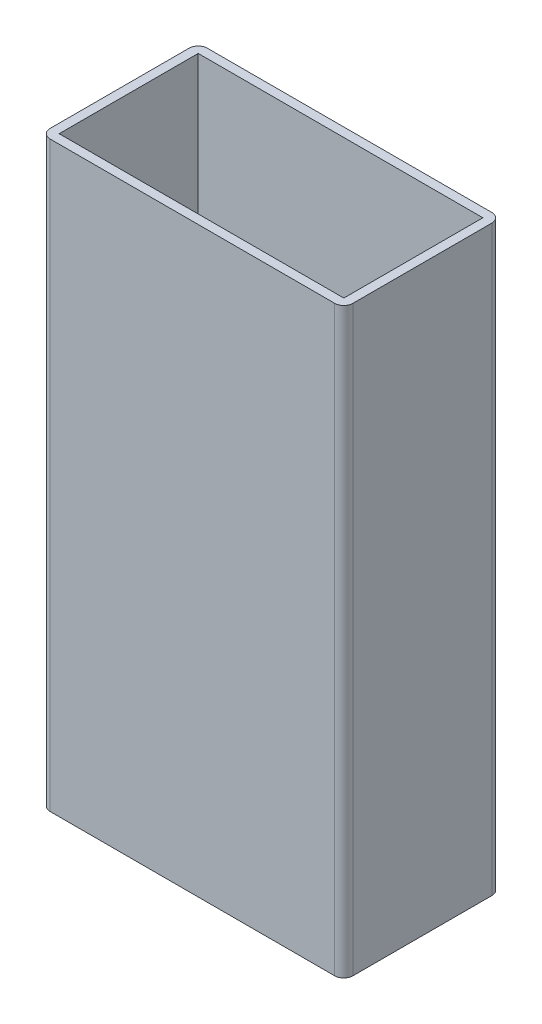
ISO-10303-21;
HEADER;
FILE_DESCRIPTION(('STEP AP214'),'2;1');
FILE_NAME('part.step','',(''),(''),'','','');
FILE_SCHEMA(('AUTOMOTIVE_DESIGN { 1 0 10303 214 1 1 1 1 }'));
ENDSEC;
DATA;
#1=APPLICATION_CONTEXT('core data for automotive mechanical design processes');
#2=APPLICATION_PROTOCOL_DEFINITION('international standard','automotive_design',2000,#1);
#3=PRODUCT_CONTEXT('',#1,'mechanical');
#4=PRODUCT('Part','Part','',(#3));
#5=PRODUCT_RELATED_PRODUCT_CATEGORY('part','',(#4));
#6=PRODUCT_DEFINITION_FORMATION('','',#4);
#7=PRODUCT_DEFINITION_CONTEXT('part definition',#1,'design');
#8=PRODUCT_DEFINITION('design','',#6,#7);
#9=PRODUCT_DEFINITION_SHAPE('','',#8);
#10=(LENGTH_UNIT() NAMED_UNIT(*) SI_UNIT(.MILLI.,.METRE.));
#11=(NAMED_UNIT(*) PLANE_ANGLE_UNIT() SI_UNIT($,.RADIAN.));
#12=(NAMED_UNIT(*) SI_UNIT($,.STERADIAN.) SOLID_ANGLE_UNIT());
#13=UNCERTAINTY_MEASURE_WITH_UNIT(LENGTH_MEASURE(1.E-05),#10,'distance_accuracy_value','');
#14=(GEOMETRIC_REPRESENTATION_CONTEXT(3) GLOBAL_UNCERTAINTY_ASSIGNED_CONTEXT((#13)) GLOBAL_UNIT_ASSIGNED_CONTEXT((#10,
#11,#12)) REPRESENTATION_CONTEXT('',''));
#15=CARTESIAN_POINT('',(0.,0.,0.));
#16=DIRECTION('',(0.,0.,1.));
#17=DIRECTION('',(1.,0.,0.));
#18=AXIS2_PLACEMENT_3D('',#15,#16,#17);
#19=CARTESIAN_POINT('',(-24.8285,101.6,12.1285));
#20=DIRECTION('',(0.,1.,0.));
#21=DIRECTION('',(0.,0.,1.));
#22=AXIS2_PLACEMENT_3D('',#19,#20,#21);
#23=PLANE('',#22);
#24=CARTESIAN_POINT('',(-24.8285,101.6,12.1285));
#25=DIRECTION('',(0.,1.,0.));
#26=DIRECTION('',(0.,0.,-1.));
#27=AXIS2_PLACEMENT_3D('',#24,#25,#26);
#28=CIRCLE('',#27,1.5875);
#29=CARTESIAN_POINT('',(-26.416,101.6,12.1285));
#30=VERTEX_POINT('',#29);
#31=CARTESIAN_POINT('',(-24.8285,101.6,13.716));
#32=VERTEX_POINT('',#31);
#33=EDGE_CURVE('E219',#30,#32,#28,.T.);
#34=ORIENTED_EDGE('',*,*,#33,.T.);
#35=DIRECTION('',(1.,0.,0.));
#36=VECTOR('',#35,1.);
#37=CARTESIAN_POINT('',(-24.8285,101.6,13.716));
#38=LINE('',#37,#36);
#39=CARTESIAN_POINT('',(24.8285,101.6,13.716));
#40=VERTEX_POINT('',#39);
#41=EDGE_CURVE('E223',#32,#40,#38,.T.);
#42=ORIENTED_EDGE('',*,*,#41,.T.);
#43=CARTESIAN_POINT('',(24.8285,101.6,12.1285));
#44=DIRECTION('',(0.,1.,0.));
#45=DIRECTION('',(0.,0.,1.));
#46=AXIS2_PLACEMENT_3D('',#43,#44,#45);
#47=CIRCLE('',#46,1.5875);
#48=CARTESIAN_POINT('',(26.416,101.6,12.1285));
#49=VERTEX_POINT('',#48);
#50=EDGE_CURVE('E227',#40,#49,#47,.T.);
#51=ORIENTED_EDGE('',*,*,#50,.T.);
#52=DIRECTION('',(0.,0.,-1.));
#53=VECTOR('',#52,1.);
#54=CARTESIAN_POINT('',(26.416,101.6,12.1285));
#55=LINE('',#54,#53);
#56=CARTESIAN_POINT('',(26.416,101.6,-12.1285));
#57=VERTEX_POINT('',#56);
#58=EDGE_CURVE('E230',#49,#57,#55,.T.);
#59=ORIENTED_EDGE('',*,*,#58,.T.);
#60=CARTESIAN_POINT('',(24.8285,101.6,-12.1285));
#61=DIRECTION('',(0.,1.,0.));
#62=DIRECTION('',(0.,0.,-1.));
#63=AXIS2_PLACEMENT_3D('',#60,#61,#62);
#64=CIRCLE('',#63,1.5875);
#65=CARTESIAN_POINT('',(24.8285,101.6,-13.716));
#66=VERTEX_POINT('',#65);
#67=EDGE_CURVE('E233',#57,#66,#64,.T.);
#68=ORIENTED_EDGE('',*,*,#67,.T.);
#69=DIRECTION('',(-1.,0.,0.));
#70=VECTOR('',#69,1.);
#71=CARTESIAN_POINT('',(-24.8285,101.6,-13.716));
#72=LINE('',#71,#70);
#73=CARTESIAN_POINT('',(-24.8285,101.6,-13.716));
#74=VERTEX_POINT('',#73);
#75=EDGE_CURVE('E236',#66,#74,#72,.T.);
#76=ORIENTED_EDGE('',*,*,#75,.T.);
#77=CARTESIAN_POINT('',(-24.8285,101.6,-12.1285));
#78=DIRECTION('',(0.,1.,0.));
#79=DIRECTION('',(0.,0.,-1.));
#80=AXIS2_PLACEMENT_3D('',#77,#78,#79);
#81=CIRCLE('',#80,1.5875);
#82=CARTESIAN_POINT('',(-26.416,101.6,-12.1285));
#83=VERTEX_POINT('',#82);
#84=EDGE_CURVE('E239',#74,#83,#81,.T.);
#85=ORIENTED_EDGE('',*,*,#84,.T.);
#86=DIRECTION('',(0.,0.,1.));
#87=VECTOR('',#86,1.);
#88=CARTESIAN_POINT('',(-26.416,101.6,12.1285));
#89=LINE('',#88,#87);
#90=EDGE_CURVE('E242',#83,#30,#89,.T.);
#91=ORIENTED_EDGE('',*,*,#90,.T.);
#92=EDGE_LOOP('',(#34,#42,#51,#59,#68,#76,#85,#91));
#93=FACE_BOUND('',#92,.T.);
#94=DIRECTION('',(1.,0.,0.));
#95=VECTOR('',#94,1.);
#96=CARTESIAN_POINT('',(-24.8285,101.6,12.1285));
#97=LINE('',#96,#95);
#98=CARTESIAN_POINT('',(-24.8285,101.6,12.1285));
#99=VERTEX_POINT('',#98);
#100=CARTESIAN_POINT('',(24.8285,101.6,12.1285));
#101=VERTEX_POINT('',#100);
#102=EDGE_CURVE('E180',#99,#101,#97,.T.);
#103=ORIENTED_EDGE('',*,*,#102,.F.);
#104=DIRECTION('',(0.,0.,1.));
#105=VECTOR('',#104,1.);
#106=CARTESIAN_POINT('',(-24.8285,101.6,12.1285));
#107=LINE('',#106,#105);
#108=CARTESIAN_POINT('',(-24.8285,101.6,-12.1285));
#109=VERTEX_POINT('',#108);
#110=EDGE_CURVE('E171',#109,#99,#107,.T.);
#111=ORIENTED_EDGE('',*,*,#110,.F.);
#112=DIRECTION('',(-1.,0.,0.));
#113=VECTOR('',#112,1.);
#114=CARTESIAN_POINT('',(-24.8285,101.6,-12.1285));
#115=LINE('',#114,#113);
#116=CARTESIAN_POINT('',(24.8285,101.6,-12.1285));
#117=VERTEX_POINT('',#116);
#118=EDGE_CURVE('E197',#117,#109,#115,.T.);
#119=ORIENTED_EDGE('',*,*,#118,.F.);
#120=DIRECTION('',(0.,0.,-1.));
#121=VECTOR('',#120,1.);
#122=CARTESIAN_POINT('',(24.8285,101.6,12.1285));
#123=LINE('',#122,#121);
#124=EDGE_CURVE('E193',#101,#117,#123,.T.);
#125=ORIENTED_EDGE('',*,*,#124,.F.);
#126=EDGE_LOOP('',(#103,#111,#119,#125));
#127=FACE_BOUND('',#126,.T.);
#128=ADVANCED_FACE('F81',(#93,#127),#23,.T.);
#129=CARTESIAN_POINT('',(-24.8285,0.,12.1285));
#130=DIRECTION('',(0.,1.,0.));
#131=DIRECTION('',(0.,0.,1.));
#132=AXIS2_PLACEMENT_3D('',#129,#130,#131);
#133=PLANE('',#132);
#134=CARTESIAN_POINT('',(-24.8285,0.,12.1285));
#135=DIRECTION('',(0.,1.,0.));
#136=DIRECTION('',(0.,0.,-1.));
#137=AXIS2_PLACEMENT_3D('',#134,#135,#136);
#138=CIRCLE('',#137,1.5875);
#139=CARTESIAN_POINT('',(-26.416,0.,12.1285));
#140=VERTEX_POINT('',#139);
#141=CARTESIAN_POINT('',(-24.8285,0.,13.716));
#142=VERTEX_POINT('',#141);
#143=EDGE_CURVE('E189',#140,#142,#138,.T.);
#144=ORIENTED_EDGE('',*,*,#143,.F.);
#145=DIRECTION('',(0.,0.,1.));
#146=VECTOR('',#145,1.);
#147=CARTESIAN_POINT('',(-26.416,0.,12.1285));
#148=LINE('',#147,#146);
#149=CARTESIAN_POINT('',(-26.416,0.,-12.1285));
#150=VERTEX_POINT('',#149);
#151=EDGE_CURVE('E224',#150,#140,#148,.T.);
#152=ORIENTED_EDGE('',*,*,#151,.F.);
#153=CARTESIAN_POINT('',(-24.8285,0.,-12.1285));
#154=DIRECTION('',(0.,1.,0.));
#155=DIRECTION('',(0.,0.,-1.));
#156=AXIS2_PLACEMENT_3D('',#153,#154,#155);
#157=CIRCLE('',#156,1.5875);
#158=CARTESIAN_POINT('',(-24.8285,0.,-13.716));
#159=VERTEX_POINT('',#158);
#160=EDGE_CURVE('E264',#159,#150,#157,.T.);
#161=ORIENTED_EDGE('',*,*,#160,.F.);
#162=DIRECTION('',(-1.,0.,0.));
#163=VECTOR('',#162,1.);
#164=CARTESIAN_POINT('',(-24.8285,0.,-13.716));
#165=LINE('',#164,#163);
#166=CARTESIAN_POINT('',(24.8285,0.,-13.716));
#167=VERTEX_POINT('',#166);
#168=EDGE_CURVE('E261',#167,#159,#165,.T.);
#169=ORIENTED_EDGE('',*,*,#168,.F.);
#170=CARTESIAN_POINT('',(24.8285,0.,-12.1285));
#171=DIRECTION('',(0.,1.,0.));
#172=DIRECTION('',(0.,0.,-1.));
#173=AXIS2_PLACEMENT_3D('',#170,#171,#172);
#174=CIRCLE('',#173,1.5875);
#175=CARTESIAN_POINT('',(26.416,0.,-12.1285));
#176=VERTEX_POINT('',#175);
#177=EDGE_CURVE('E258',#176,#167,#174,.T.);
#178=ORIENTED_EDGE('',*,*,#177,.F.);
#179=DIRECTION('',(0.,0.,-1.));
#180=VECTOR('',#179,1.);
#181=CARTESIAN_POINT('',(26.416,0.,12.1285));
#182=LINE('',#181,#180);
#183=CARTESIAN_POINT('',(26.416,0.,12.1285));
#184=VERTEX_POINT('',#183);
#185=EDGE_CURVE('E255',#184,#176,#182,.T.);
#186=ORIENTED_EDGE('',*,*,#185,.F.);
#187=CARTESIAN_POINT('',(24.8285,0.,12.1285));
#188=DIRECTION('',(0.,1.,0.));
#189=DIRECTION('',(0.,0.,1.));
#190=AXIS2_PLACEMENT_3D('',#187,#188,#189);
#191=CIRCLE('',#190,1.5875);
#192=CARTESIAN_POINT('',(24.8285,0.,13.716));
#193=VERTEX_POINT('',#192);
#194=EDGE_CURVE('E252',#193,#184,#191,.T.);
#195=ORIENTED_EDGE('',*,*,#194,.F.);
#196=DIRECTION('',(1.,0.,0.));
#197=VECTOR('',#196,1.);
#198=CARTESIAN_POINT('',(-24.8285,0.,13.716));
#199=LINE('',#198,#197);
#200=EDGE_CURVE('E249',#142,#193,#199,.T.);
#201=ORIENTED_EDGE('',*,*,#200,.F.);
#202=EDGE_LOOP('',(#144,#152,#161,#169,#178,#186,#195,#201));
#203=FACE_BOUND('',#202,.T.);
#204=DIRECTION('',(0.,0.,1.));
#205=VECTOR('',#204,1.);
#206=CARTESIAN_POINT('',(-24.8285,0.,12.1285));
#207=LINE('',#206,#205);
#208=CARTESIAN_POINT('',(-24.8285,0.,-12.1285));
#209=VERTEX_POINT('',#208);
#210=CARTESIAN_POINT('',(-24.8285,0.,12.1285));
#211=VERTEX_POINT('',#210);
#212=EDGE_CURVE('E105',#209,#211,#207,.T.);
#213=ORIENTED_EDGE('',*,*,#212,.T.);
#214=DIRECTION('',(1.,0.,0.));
#215=VECTOR('',#214,1.);
#216=CARTESIAN_POINT('',(-24.8285,0.,12.1285));
#217=LINE('',#216,#215);
#218=CARTESIAN_POINT('',(24.8285,0.,12.1285));
#219=VERTEX_POINT('',#218);
#220=EDGE_CURVE('E187',#211,#219,#217,.T.);
#221=ORIENTED_EDGE('',*,*,#220,.T.);
#222=DIRECTION('',(0.,0.,-1.));
#223=VECTOR('',#222,1.);
#224=CARTESIAN_POINT('',(24.8285,0.,12.1285));
#225=LINE('',#224,#223);
#226=CARTESIAN_POINT('',(24.8285,0.,-12.1285));
#227=VERTEX_POINT('',#226);
#228=EDGE_CURVE('E206',#219,#227,#225,.T.);
#229=ORIENTED_EDGE('',*,*,#228,.T.);
#230=DIRECTION('',(-1.,0.,0.));
#231=VECTOR('',#230,1.);
#232=CARTESIAN_POINT('',(-24.8285,0.,-12.1285));
#233=LINE('',#232,#231);
#234=EDGE_CURVE('E181',#227,#209,#233,.T.);
#235=ORIENTED_EDGE('',*,*,#234,.T.);
#236=EDGE_LOOP('',(#213,#221,#229,#235));
#237=FACE_BOUND('',#236,.T.);
#238=ADVANCED_FACE('F303',(#203,#237),#133,.F.);
#239=CARTESIAN_POINT('',(-24.8285,101.6,12.1285));
#240=DIRECTION('',(0.,-1.,0.));
#241=DIRECTION('',(0.,0.,-1.));
#242=AXIS2_PLACEMENT_3D('',#239,#240,#241);
#243=CYLINDRICAL_SURFACE('',#242,1.5875);
#244=ORIENTED_EDGE('',*,*,#143,.T.);
#245=DIRECTION('',(0.,-1.,0.));
#246=VECTOR('',#245,1.);
#247=CARTESIAN_POINT('',(-24.8285,101.6,13.716));
#248=LINE('',#247,#246);
#249=EDGE_CURVE('E12',#32,#142,#248,.T.);
#250=ORIENTED_EDGE('',*,*,#249,.F.);
#251=ORIENTED_EDGE('',*,*,#33,.F.);
#252=DIRECTION('',(0.,-1.,0.));
#253=VECTOR('',#252,1.);
#254=CARTESIAN_POINT('',(-26.416,101.6,12.1285));
#255=LINE('',#254,#253);
#256=EDGE_CURVE('E245',#30,#140,#255,.T.);
#257=ORIENTED_EDGE('',*,*,#256,.T.);
#258=EDGE_LOOP('',(#244,#250,#251,#257));
#259=FACE_BOUND('',#258,.T.);
#260=ADVANCED_FACE('F83',(#259),#243,.T.);
#261=CARTESIAN_POINT('',(-24.8285,101.6,13.716));
#262=DIRECTION('',(0.,0.,-1.));
#263=DIRECTION('',(-1.,0.,0.));
#264=AXIS2_PLACEMENT_3D('',#261,#262,#263);
#265=PLANE('',#264);
#266=ORIENTED_EDGE('',*,*,#200,.T.);
#267=DIRECTION('',(0.,-1.,0.));
#268=VECTOR('',#267,1.);
#269=CARTESIAN_POINT('',(24.8285,101.6,13.716));
#270=LINE('',#269,#268);
#271=EDGE_CURVE('E90',#40,#193,#270,.T.);
#272=ORIENTED_EDGE('',*,*,#271,.F.);
#273=ORIENTED_EDGE('',*,*,#41,.F.);
#274=ORIENTED_EDGE('',*,*,#249,.T.);
#275=EDGE_LOOP('',(#266,#272,#273,#274));
#276=FACE_BOUND('',#275,.T.);
#277=ADVANCED_FACE('F320',(#276),#265,.F.);
#278=CARTESIAN_POINT('',(24.8285,101.6,12.1285));
#279=DIRECTION('',(0.,-1.,0.));
#280=DIRECTION('',(0.,0.,-1.));
#281=AXIS2_PLACEMENT_3D('',#278,#279,#280);
#282=CYLINDRICAL_SURFACE('',#281,1.5875);
#283=ORIENTED_EDGE('',*,*,#194,.T.);
#284=DIRECTION('',(0.,-1.,0.));
#285=VECTOR('',#284,1.);
#286=CARTESIAN_POINT('',(26.416,101.6,12.1285));
#287=LINE('',#286,#285);
#288=EDGE_CURVE('E288',#49,#184,#287,.T.);
#289=ORIENTED_EDGE('',*,*,#288,.F.);
#290=ORIENTED_EDGE('',*,*,#50,.F.);
#291=ORIENTED_EDGE('',*,*,#271,.T.);
#292=EDGE_LOOP('',(#283,#289,#290,#291));
#293=FACE_BOUND('',#292,.T.);
#294=ADVANCED_FACE('F297',(#293),#282,.T.);
#295=CARTESIAN_POINT('',(26.416,101.6,12.1285));
#296=DIRECTION('',(-1.,0.,0.));
#297=DIRECTION('',(0.,0.,1.));
#298=AXIS2_PLACEMENT_3D('',#295,#296,#297);
#299=PLANE('',#298);
#300=ORIENTED_EDGE('',*,*,#185,.T.);
#301=DIRECTION('',(0.,-1.,0.));
#302=VECTOR('',#301,1.);
#303=CARTESIAN_POINT('',(26.416,101.6,-12.1285));
#304=LINE('',#303,#302);
#305=EDGE_CURVE('E284',#57,#176,#304,.T.);
#306=ORIENTED_EDGE('',*,*,#305,.F.);
#307=ORIENTED_EDGE('',*,*,#58,.F.);
#308=ORIENTED_EDGE('',*,*,#288,.T.);
#309=EDGE_LOOP('',(#300,#306,#307,#308));
#310=FACE_BOUND('',#309,.T.);
#311=ADVANCED_FACE('F309',(#310),#299,.F.);
#312=CARTESIAN_POINT('',(24.8285,101.6,-12.1285));
#313=DIRECTION('',(0.,-1.,0.));
#314=DIRECTION('',(0.,0.,-1.));
#315=AXIS2_PLACEMENT_3D('',#312,#313,#314);
#316=CYLINDRICAL_SURFACE('',#315,1.5875);
#317=ORIENTED_EDGE('',*,*,#177,.T.);
#318=DIRECTION('',(0.,-1.,0.));
#319=VECTOR('',#318,1.);
#320=CARTESIAN_POINT('',(24.8285,101.6,-13.716));
#321=LINE('',#320,#319);
#322=EDGE_CURVE('E280',#66,#167,#321,.T.);
#323=ORIENTED_EDGE('',*,*,#322,.F.);
#324=ORIENTED_EDGE('',*,*,#67,.F.);
#325=ORIENTED_EDGE('',*,*,#305,.T.);
#326=EDGE_LOOP('',(#317,#323,#324,#325));
#327=FACE_BOUND('',#326,.T.);
#328=ADVANCED_FACE('F313',(#327),#316,.T.);
#329=CARTESIAN_POINT('',(-24.8285,101.6,-13.716));
#330=DIRECTION('',(0.,0.,1.));
#331=DIRECTION('',(1.,0.,0.));
#332=AXIS2_PLACEMENT_3D('',#329,#330,#331);
#333=PLANE('',#332);
#334=ORIENTED_EDGE('',*,*,#168,.T.);
#335=DIRECTION('',(0.,-1.,0.));
#336=VECTOR('',#335,1.);
#337=CARTESIAN_POINT('',(-24.8285,101.6,-13.716));
#338=LINE('',#337,#336);
#339=EDGE_CURVE('E276',#74,#159,#338,.T.);
#340=ORIENTED_EDGE('',*,*,#339,.F.);
#341=ORIENTED_EDGE('',*,*,#75,.F.);
#342=ORIENTED_EDGE('',*,*,#322,.T.);
#343=EDGE_LOOP('',(#334,#340,#341,#342));
#344=FACE_BOUND('',#343,.T.);
#345=ADVANCED_FACE('F333',(#344),#333,.F.);
#346=CARTESIAN_POINT('',(-24.8285,101.6,-12.1285));
#347=DIRECTION('',(0.,-1.,0.));
#348=DIRECTION('',(0.,0.,-1.));
#349=AXIS2_PLACEMENT_3D('',#346,#347,#348);
#350=CYLINDRICAL_SURFACE('',#349,1.5875);
#351=ORIENTED_EDGE('',*,*,#160,.T.);
#352=DIRECTION('',(0.,-1.,0.));
#353=VECTOR('',#352,1.);
#354=CARTESIAN_POINT('',(-26.416,101.6,-12.1285));
#355=LINE('',#354,#353);
#356=EDGE_CURVE('E272',#83,#150,#355,.T.);
#357=ORIENTED_EDGE('',*,*,#356,.F.);
#358=ORIENTED_EDGE('',*,*,#84,.F.);
#359=ORIENTED_EDGE('',*,*,#339,.T.);
#360=EDGE_LOOP('',(#351,#357,#358,#359));
#361=FACE_BOUND('',#360,.T.);
#362=ADVANCED_FACE('F331',(#361),#350,.T.);
#363=CARTESIAN_POINT('',(-26.416,101.6,12.1285));
#364=DIRECTION('',(1.,0.,0.));
#365=DIRECTION('',(0.,0.,-1.));
#366=AXIS2_PLACEMENT_3D('',#363,#364,#365);
#367=PLANE('',#366);
#368=ORIENTED_EDGE('',*,*,#151,.T.);
#369=ORIENTED_EDGE('',*,*,#256,.F.);
#370=ORIENTED_EDGE('',*,*,#90,.F.);
#371=ORIENTED_EDGE('',*,*,#356,.T.);
#372=EDGE_LOOP('',(#368,#369,#370,#371));
#373=FACE_BOUND('',#372,.T.);
#374=ADVANCED_FACE('F326',(#373),#367,.F.);
#375=CARTESIAN_POINT('',(-24.8285,101.6,12.1285));
#376=DIRECTION('',(1.,0.,0.));
#377=DIRECTION('',(0.,0.,-1.));
#378=AXIS2_PLACEMENT_3D('',#375,#376,#377);
#379=PLANE('',#378);
#380=ORIENTED_EDGE('',*,*,#212,.F.);
#381=DIRECTION('',(0.,-1.,0.));
#382=VECTOR('',#381,1.);
#383=CARTESIAN_POINT('',(-24.8285,101.6,-12.1285));
#384=LINE('',#383,#382);
#385=EDGE_CURVE('E175',#109,#209,#384,.T.);
#386=ORIENTED_EDGE('',*,*,#385,.F.);
#387=ORIENTED_EDGE('',*,*,#110,.T.);
#388=DIRECTION('',(0.,-1.,0.));
#389=VECTOR('',#388,1.);
#390=CARTESIAN_POINT('',(-24.8285,101.6,12.1285));
#391=LINE('',#390,#389);
#392=EDGE_CURVE('E174',#99,#211,#391,.T.);
#393=ORIENTED_EDGE('',*,*,#392,.T.);
#394=EDGE_LOOP('',(#380,#386,#387,#393));
#395=FACE_BOUND('',#394,.T.);
#396=ADVANCED_FACE('F173',(#395),#379,.T.);
#397=CARTESIAN_POINT('',(-24.8285,101.6,12.1285));
#398=DIRECTION('',(0.,0.,-1.));
#399=DIRECTION('',(-1.,0.,0.));
#400=AXIS2_PLACEMENT_3D('',#397,#398,#399);
#401=PLANE('',#400);
#402=ORIENTED_EDGE('',*,*,#220,.F.);
#403=ORIENTED_EDGE('',*,*,#392,.F.);
#404=ORIENTED_EDGE('',*,*,#102,.T.);
#405=DIRECTION('',(0.,-1.,0.));
#406=VECTOR('',#405,1.);
#407=CARTESIAN_POINT('',(24.8285,101.6,12.1285));
#408=LINE('',#407,#406);
#409=EDGE_CURVE('E190',#101,#219,#408,.T.);
#410=ORIENTED_EDGE('',*,*,#409,.T.);
#411=EDGE_LOOP('',(#402,#403,#404,#410));
#412=FACE_BOUND('',#411,.T.);
#413=ADVANCED_FACE('F184',(#412),#401,.T.);
#414=CARTESIAN_POINT('',(24.8285,101.6,12.1285));
#415=DIRECTION('',(-1.,0.,0.));
#416=DIRECTION('',(0.,0.,1.));
#417=AXIS2_PLACEMENT_3D('',#414,#415,#416);
#418=PLANE('',#417);
#419=ORIENTED_EDGE('',*,*,#228,.F.);
#420=ORIENTED_EDGE('',*,*,#409,.F.);
#421=ORIENTED_EDGE('',*,*,#124,.T.);
#422=DIRECTION('',(0.,-1.,0.));
#423=VECTOR('',#422,1.);
#424=CARTESIAN_POINT('',(24.8285,101.6,-12.1285));
#425=LINE('',#424,#423);
#426=EDGE_CURVE('E97',#117,#227,#425,.T.);
#427=ORIENTED_EDGE('',*,*,#426,.T.);
#428=EDGE_LOOP('',(#419,#420,#421,#427));
#429=FACE_BOUND('',#428,.T.);
#430=ADVANCED_FACE('F358',(#429),#418,.T.);
#431=CARTESIAN_POINT('',(-24.8285,101.6,-12.1285));
#432=DIRECTION('',(0.,0.,1.));
#433=DIRECTION('',(1.,0.,0.));
#434=AXIS2_PLACEMENT_3D('',#431,#432,#433);
#435=PLANE('',#434);
#436=ORIENTED_EDGE('',*,*,#234,.F.);
#437=ORIENTED_EDGE('',*,*,#426,.F.);
#438=ORIENTED_EDGE('',*,*,#118,.T.);
#439=ORIENTED_EDGE('',*,*,#385,.T.);
#440=EDGE_LOOP('',(#436,#437,#438,#439));
#441=FACE_BOUND('',#440,.T.);
#442=ADVANCED_FACE('F362',(#441),#435,.T.);
#443=CLOSED_SHELL('',(#128,#238,#260,#277,#294,#311,#328,#345,#362,#374,#396,#413,#430,#442));
#444=MANIFOLD_SOLID_BREP('B2',#443);
#445=ADVANCED_BREP_SHAPE_REPRESENTATION('',(#18,#444),#14);
#446=SHAPE_DEFINITION_REPRESENTATION(#9,#445);
ENDSEC;
END-ISO-10303-21;
